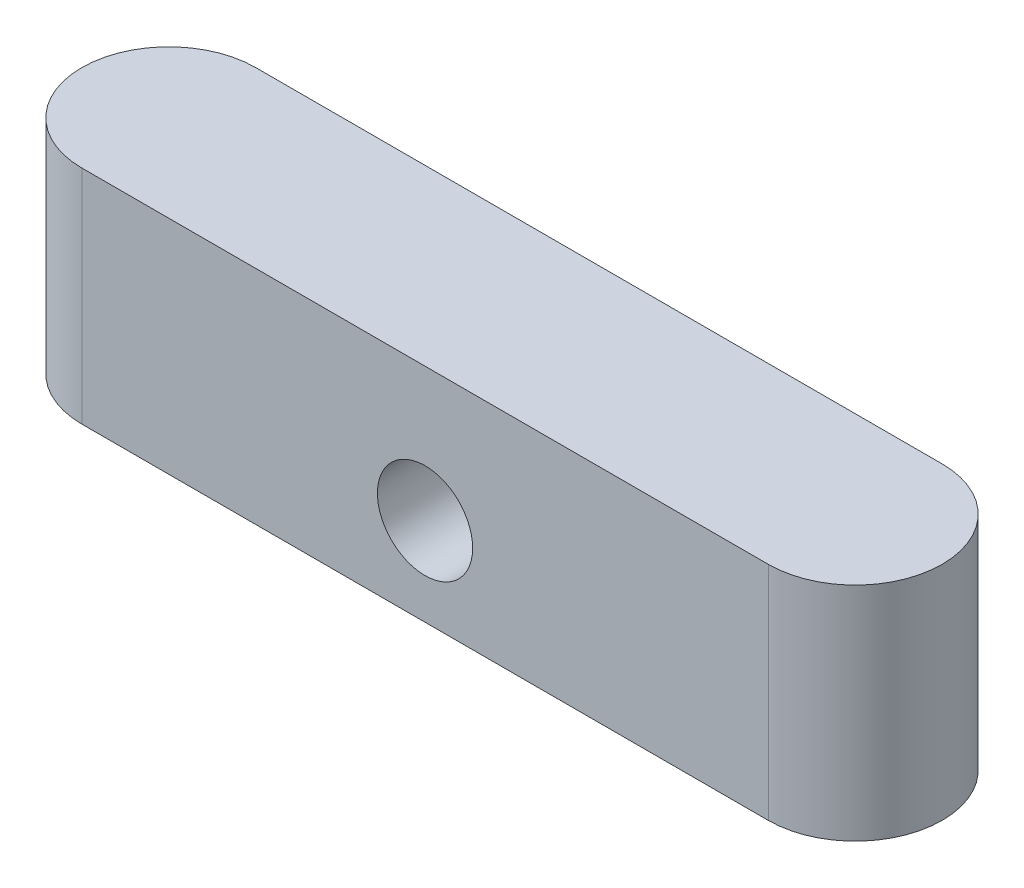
from build123d import *

# Parameters (mm, degrees)
BOSS_EXTRUDE1_DEPTH   = 3.15
F_6_32_TAPPED_HOLE1_D = 2.7051


with BuildPart() as part:
    # Sketch1 → Boss-Extrude1 (new, symmetric)
    with BuildSketch(Plane(origin=(0, 0, 0), x_dir=(1, 0, 0), z_dir=(0, 1, 0))):
        with BuildLine():
            Line((-9.75, 2.47015), (9.75, 2.47015))
            ThreePointArc((9.75, 2.47015), (12.22015, 0), (9.75, -2.47015))
            Line((9.75, -2.47015), (-9.75, -2.47015))
            ThreePointArc((-9.75, -2.47015), (-12.22015, 0), (-9.75, 2.47015))
        make_face()
    extrude(amount=BOSS_EXTRUDE1_DEPTH, both=True)

    # 6-32 Tapped Hole1 (through all)
    with Locations(Plane.XY.offset(2.47015)):
        with Locations((0, -0.65)):
            Hole(F_6_32_TAPPED_HOLE1_D / 2)


solid = part.part
